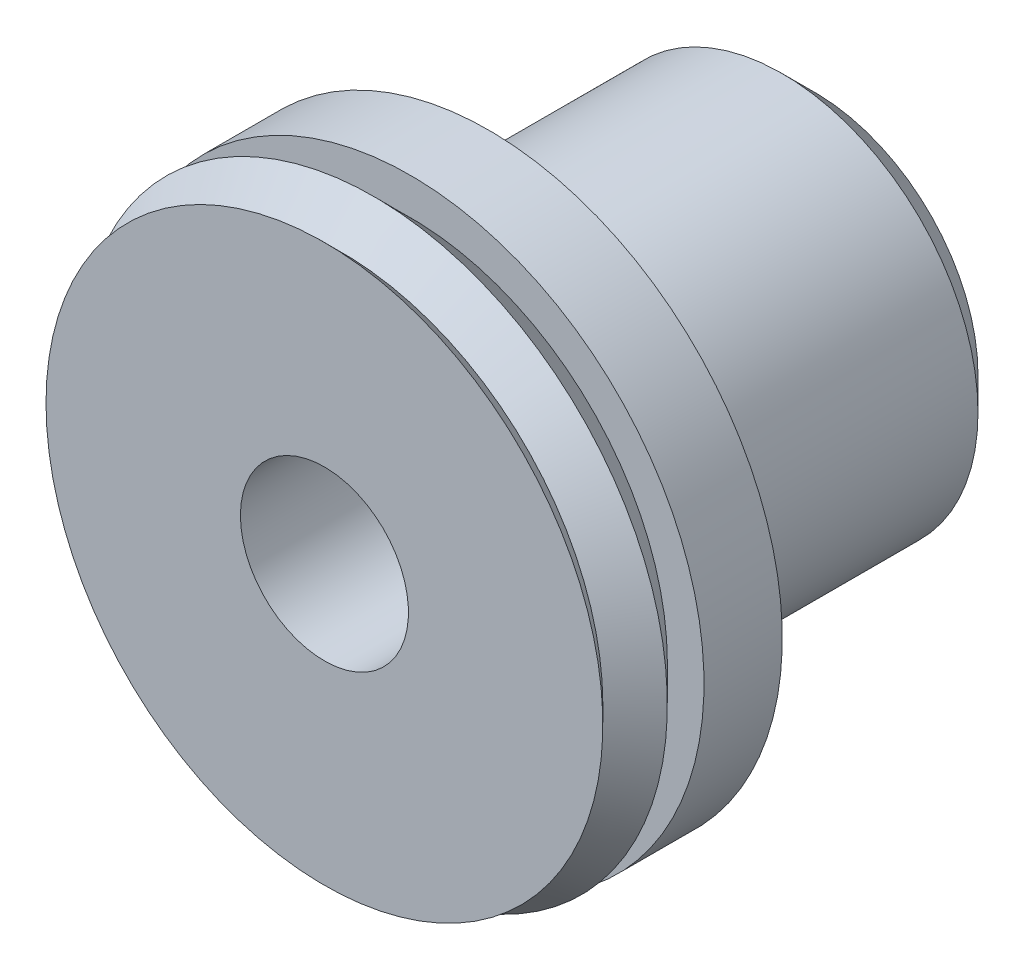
from build123d import *

# Parameters (mm, degrees)
SKETCH15_R                      = 4.7625
SINGLE_ACTING_STUD_DEPTH        = 7.9375
SINGLE_ACTING_STUD_CHAMFER_SIZE = 0.79375
SKETCH3_R                       = 2.0447
HOLE_CUT_DEPTH                  = 16.637378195


with BuildPart() as part:
    # Sketch1 → Base (revolve)
    with BuildSketch(Plane(origin=(0, 0, 0), x_dir=(0, 0, -1), z_dir=(1, 0, 0)), mode=Mode.PRIVATE) as base_sk:
        Polygon((0, 0), (0, 6.77545), (0.41656, 6.35889), (1.20142, 7.14375), (2.093214, 6.251956), (2.093214, 7.14375), (3.998214, 7.14375), (3.998214, 0), align=None)
    revolve(base_sk.sketch.rotate(Axis((0, 0, -71.294124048), (0, 0, 1)), 90), axis=Axis((0, 0, -71.294124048), (0, 0, 1)))

    # Sketch15 → Single Acting Stud (add)
    with BuildSketch(Plane.XY.offset(-3.998214)):
        Circle(SKETCH15_R)
    extrude(amount=-SINGLE_ACTING_STUD_DEPTH)

    # Single Acting Stud Chamfer
    single_acting_stud_chamfer_edges = [part.edges().sort_by_distance(p)[0] for p in [
        (-4.7625, 0, -11.935714),
    ]]
    chamfer(single_acting_stud_chamfer_edges, length=SINGLE_ACTING_STUD_CHAMFER_SIZE)

    # Sketch3 → Hole Cut (cut, through all)
    with BuildSketch(Plane(origin=(0, 0, 0), x_dir=(-1, 0, 0), z_dir=(0, 0, -1))):
        Circle(SKETCH3_R)
    extrude(amount=HOLE_CUT_DEPTH, mode=Mode.SUBTRACT)


solid = part.part
